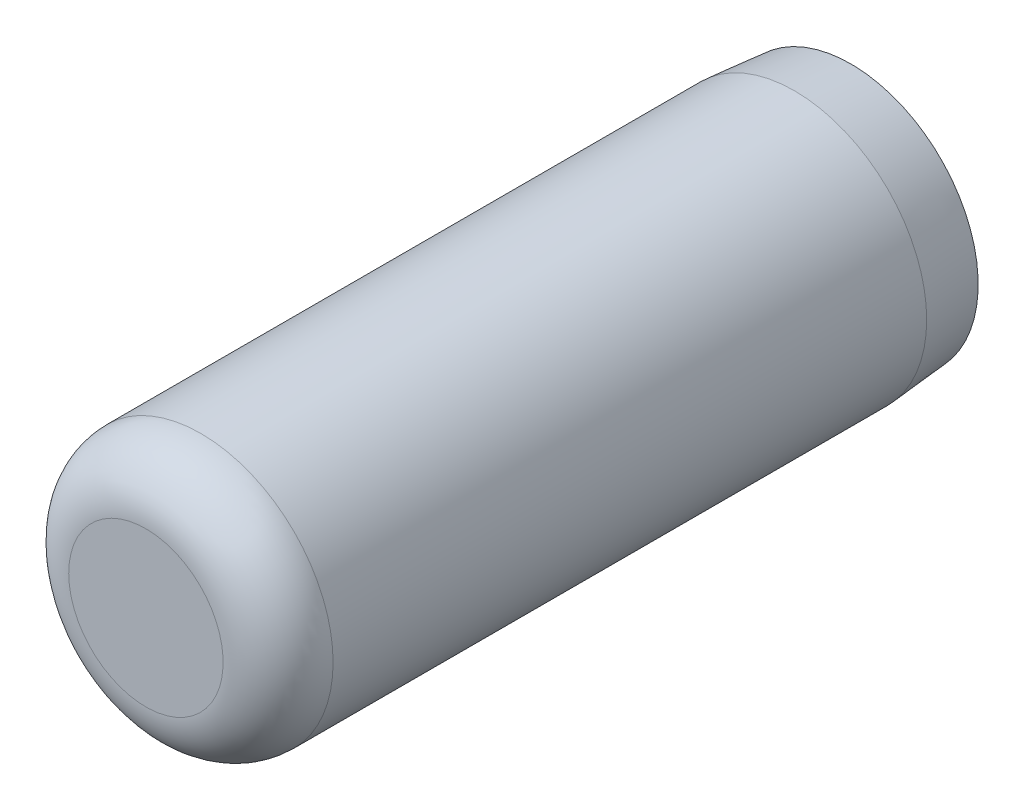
ISO-10303-21;
HEADER;
FILE_DESCRIPTION(('STEP AP214'),'2;1');
FILE_NAME('part.step','',(''),(''),'','','');
FILE_SCHEMA(('AUTOMOTIVE_DESIGN { 1 0 10303 214 1 1 1 1 }'));
ENDSEC;
DATA;
#1=APPLICATION_CONTEXT('core data for automotive mechanical design processes');
#2=APPLICATION_PROTOCOL_DEFINITION('international standard','automotive_design',2000,#1);
#3=PRODUCT_CONTEXT('',#1,'mechanical');
#4=PRODUCT('Part','Part','',(#3));
#5=PRODUCT_RELATED_PRODUCT_CATEGORY('part','',(#4));
#6=PRODUCT_DEFINITION_FORMATION('','',#4);
#7=PRODUCT_DEFINITION_CONTEXT('part definition',#1,'design');
#8=PRODUCT_DEFINITION('design','',#6,#7);
#9=PRODUCT_DEFINITION_SHAPE('','',#8);
#10=(LENGTH_UNIT() NAMED_UNIT(*) SI_UNIT(.MILLI.,.METRE.));
#11=(NAMED_UNIT(*) PLANE_ANGLE_UNIT() SI_UNIT($,.RADIAN.));
#12=(NAMED_UNIT(*) SI_UNIT($,.STERADIAN.) SOLID_ANGLE_UNIT());
#13=UNCERTAINTY_MEASURE_WITH_UNIT(LENGTH_MEASURE(1.E-05),#10,'distance_accuracy_value','');
#14=(GEOMETRIC_REPRESENTATION_CONTEXT(3) GLOBAL_UNCERTAINTY_ASSIGNED_CONTEXT((#13)) GLOBAL_UNIT_ASSIGNED_CONTEXT((#10,
#11,#12)) REPRESENTATION_CONTEXT('',''));
#15=CARTESIAN_POINT('',(0.,0.,0.));
#16=DIRECTION('',(0.,0.,1.));
#17=DIRECTION('',(1.,0.,0.));
#18=AXIS2_PLACEMENT_3D('',#15,#16,#17);
#19=CARTESIAN_POINT('',(0.,0.,4.3688));
#20=DIRECTION('',(0.,0.,-1.));
#21=DIRECTION('',(-1.,0.,0.));
#22=AXIS2_PLACEMENT_3D('',#19,#20,#21);
#23=TOROIDAL_SURFACE('',#22,2.7813,1.9812);
#24=CARTESIAN_POINT('',(0.,0.,4.3688));
#25=DIRECTION('',(0.,0.,-1.));
#26=DIRECTION('',(-1.,0.,0.));
#27=AXIS2_PLACEMENT_3D('',#24,#25,#26);
#28=CIRCLE('',#27,4.7625);
#29=CARTESIAN_POINT('',(-4.7625,0.,4.3688));
#30=VERTEX_POINT('',#29);
#31=EDGE_CURVE('E10',#30,#30,#28,.T.);
#32=ORIENTED_EDGE('',*,*,#31,.F.);
#33=EDGE_LOOP('',(#32));
#34=FACE_BOUND('',#33,.T.);
#35=CARTESIAN_POINT('',(0.,0.,6.35));
#36=DIRECTION('',(0.,0.,-1.));
#37=DIRECTION('',(-1.,0.,0.));
#38=AXIS2_PLACEMENT_3D('',#35,#36,#37);
#39=CIRCLE('',#38,2.7813);
#40=CARTESIAN_POINT('',(-2.7813,0.,6.35));
#41=VERTEX_POINT('',#40);
#42=EDGE_CURVE('E34',#41,#41,#39,.T.);
#43=ORIENTED_EDGE('',*,*,#42,.T.);
#44=EDGE_LOOP('',(#43));
#45=FACE_BOUND('',#44,.T.);
#46=ADVANCED_FACE('F14',(#34,#45),#23,.T.);
#47=CARTESIAN_POINT('',(0.,0.,-47.5372037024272));
#48=DIRECTION('',(0.,0.,-1.));
#49=DIRECTION('',(-1.,0.,0.));
#50=AXIS2_PLACEMENT_3D('',#47,#48,#49);
#51=CYLINDRICAL_SURFACE('',#50,4.7625);
#52=CARTESIAN_POINT('',(0.,0.,-17.018));
#53=DIRECTION('',(0.,0.,-1.));
#54=DIRECTION('',(-1.,0.,0.));
#55=AXIS2_PLACEMENT_3D('',#52,#53,#54);
#56=CIRCLE('',#55,4.7625);
#57=CARTESIAN_POINT('',(-4.7625,0.,-17.018));
#58=VERTEX_POINT('',#57);
#59=EDGE_CURVE('E21',#58,#58,#56,.T.);
#60=ORIENTED_EDGE('',*,*,#59,.F.);
#61=EDGE_LOOP('',(#60));
#62=FACE_BOUND('',#61,.T.);
#63=ORIENTED_EDGE('',*,*,#31,.T.);
#64=EDGE_LOOP('',(#63));
#65=FACE_BOUND('',#64,.T.);
#66=ADVANCED_FACE('F55',(#62,#65),#51,.T.);
#67=CARTESIAN_POINT('',(0.,0.,-17.018));
#68=DIRECTION('',(0.,0.,1.));
#69=DIRECTION('',(1.,0.,0.));
#70=AXIS2_PLACEMENT_3D('',#67,#68,#69);
#71=CONICAL_SURFACE('',#70,4.7625,0.0872664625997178);
#72=CARTESIAN_POINT('',(0.,0.,-19.05));
#73=DIRECTION('',(0.,0.,-1.));
#74=DIRECTION('',(-1.,0.,0.));
#75=AXIS2_PLACEMENT_3D('',#72,#73,#74);
#76=CIRCLE('',#75,4.58472303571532);
#77=CARTESIAN_POINT('',(-4.58472303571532,0.,-19.05));
#78=VERTEX_POINT('',#77);
#79=EDGE_CURVE('E28',#78,#78,#76,.T.);
#80=ORIENTED_EDGE('',*,*,#79,.F.);
#81=EDGE_LOOP('',(#80));
#82=FACE_BOUND('',#81,.T.);
#83=ORIENTED_EDGE('',*,*,#59,.T.);
#84=EDGE_LOOP('',(#83));
#85=FACE_BOUND('',#84,.T.);
#86=ADVANCED_FACE('F51',(#82,#85),#71,.T.);
#87=CARTESIAN_POINT('',(0.,0.,-19.05));
#88=DIRECTION('',(0.,0.,1.));
#89=DIRECTION('',(1.,0.,0.));
#90=AXIS2_PLACEMENT_3D('',#87,#88,#89);
#91=PLANE('',#90);
#92=ORIENTED_EDGE('',*,*,#79,.T.);
#93=EDGE_LOOP('',(#92));
#94=FACE_BOUND('',#93,.T.);
#95=ADVANCED_FACE('F45',(#94),#91,.F.);
#96=CARTESIAN_POINT('',(0.,0.,6.35));
#97=DIRECTION('',(0.,0.,-1.));
#98=DIRECTION('',(-1.,0.,0.));
#99=AXIS2_PLACEMENT_3D('',#96,#97,#98);
#100=PLANE('',#99);
#101=ORIENTED_EDGE('',*,*,#42,.F.);
#102=EDGE_LOOP('',(#101));
#103=FACE_BOUND('',#102,.T.);
#104=ADVANCED_FACE('F43',(#103),#100,.F.);
#105=CLOSED_SHELL('',(#46,#66,#86,#95,#104));
#106=MANIFOLD_SOLID_BREP('B1',#105);
#107=ADVANCED_BREP_SHAPE_REPRESENTATION('',(#18,#106),#14);
#108=SHAPE_DEFINITION_REPRESENTATION(#9,#107);
ENDSEC;
END-ISO-10303-21;
